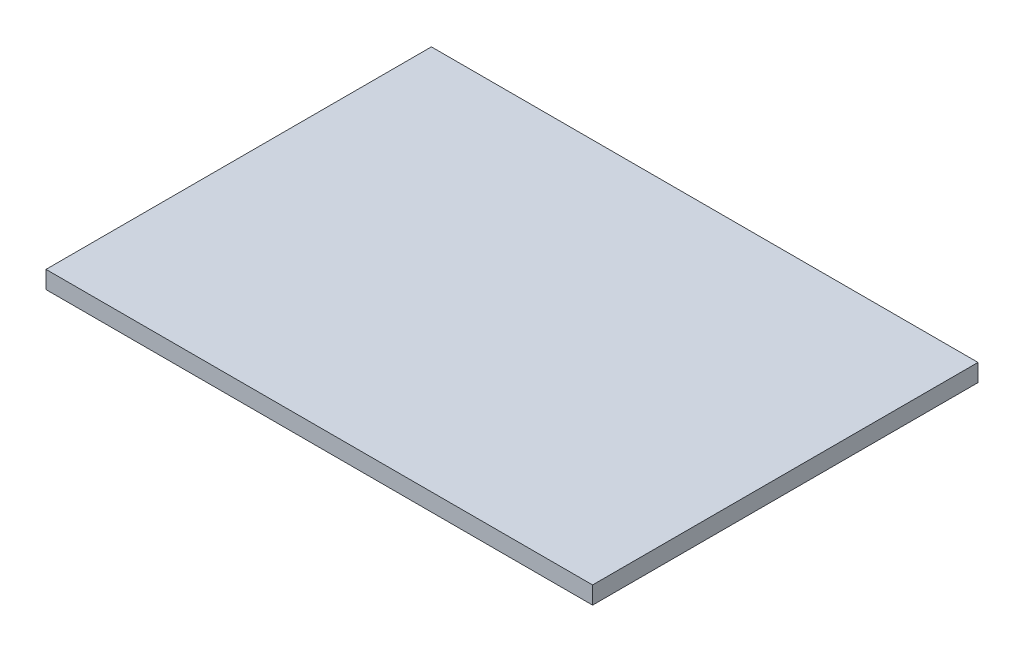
from build123d import *

# Parameters (mm, degrees)
ESQUISSE1_W        = 312
ESQUISSE1_H        = 10
BOSS_EXTRU_1_DEPTH = 220


with BuildPart() as part:
    # Esquisse1 → Boss.-Extru.1 (new body)
    with BuildSketch(Plane.XY):
        with Locations((49.844665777, 44.19972067)):
            Rectangle(ESQUISSE1_W, ESQUISSE1_H)
    extrude(amount=BOSS_EXTRU_1_DEPTH)


solid = part.part
